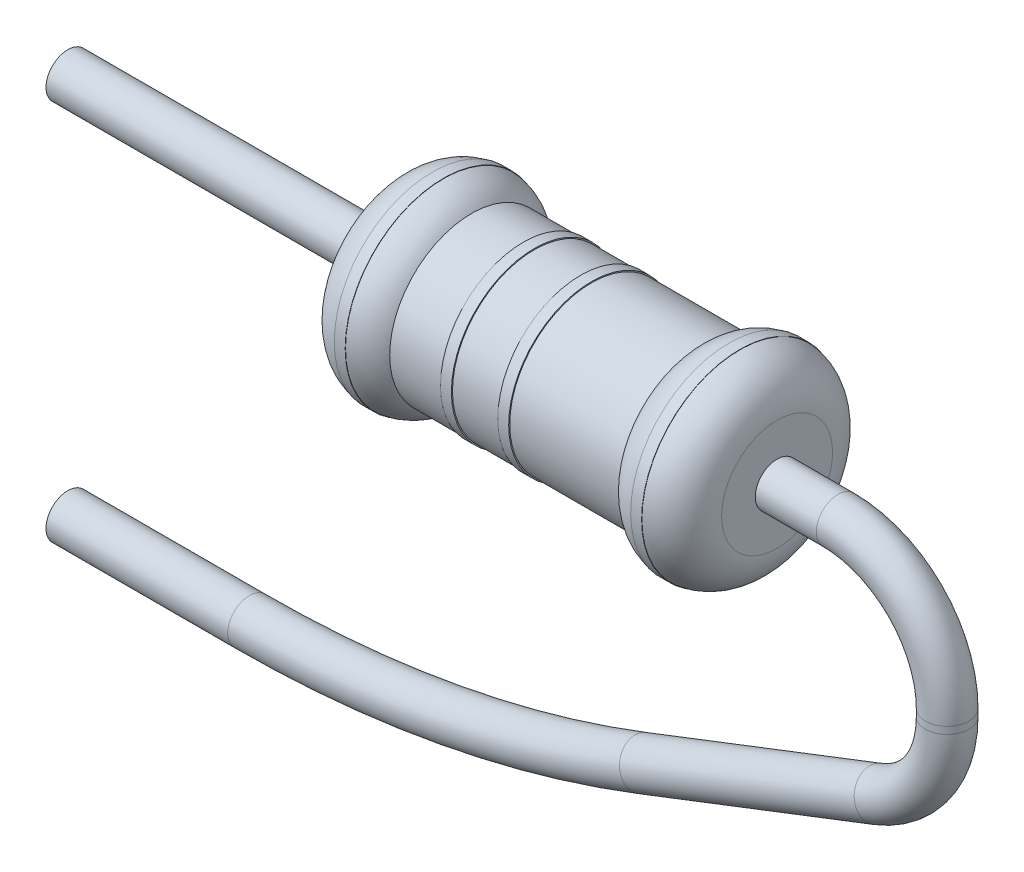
from build123d import *

# Parameters (mm, degrees)
ESQUISSE3_R = 0.2
ESQUISSE5_R = 0.2


with BuildPart() as part:
    # Esquisse1 → R_volution1 (revolve)
    with BuildSketch(Plane.XY, mode=Mode.PRIVATE) as r_volution1_sk:
        with BuildLine():
            Line((-1.75, 0), (1.75, 0))
            Line((1.75, 0), (1.75, 0.508257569))
            ThreePointArc((1.75, 0.508257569), (1.652408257, 0.766980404), (1.408257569, 0.896796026))
            Line((1.408257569, 0.896796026), (1.408257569, 0.9))
            Line((1.408257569, 0.9), (1.308257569, 0.9))
            Line((1.308257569, 0.9), (1.308257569, 0.896796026))
            ThreePointArc((1.308257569, 0.896796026), (1.164674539, 0.848827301), (1.05, 0.75))
            Line((1.05, 0.75), (0.05, 0.75))
            Line((0.05, 0.75), (0.05, 0.76))
            Line((0.05, 0.76), (-0.05, 0.76))
            Line((-0.05, 0.76), (-0.05, 0.75))
            Line((-0.05, 0.75), (-0.475, 0.75))
            Line((-0.475, 0.75), (-0.475, 0.76))
            Line((-0.475, 0.76), (-0.575, 0.76))
            Line((-0.575, 0.76), (-0.575, 0.75))
            Line((-0.575, 0.75), (-1.05, 0.75))
            ThreePointArc((-1.05, 0.75), (-1.164674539, 0.848827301), (-1.308257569, 0.896796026))
            Line((-1.308257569, 0.896796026), (-1.308257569, 0.9))
            Line((-1.308257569, 0.9), (-1.408257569, 0.9))
            Line((-1.408257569, 0.9), (-1.408257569, 0.896796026))
            ThreePointArc((-1.408257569, 0.896796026), (-1.652408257, 0.766980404), (-1.75, 0.508257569))
            Line((-1.75, 0.508257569), (-1.75, 0))
        make_face()
    revolve(r_volution1_sk.sketch.rotate(Axis((-9.420048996, 0, 0), (1, 0, 0)), 90), axis=Axis((-9.420048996, 0, 0), (1, 0, 0)))

    # Balayage1: sweep along a path in Esquisse2
    with BuildLine(Plane.XY) as balayage1_path:
        Line((-4.75, 0), (-1.75, 0))
    # Esquisse3 → Balayage1 (sweep)
    with BuildSketch(Plane.ZY.offset(1.75)):
        Circle(ESQUISSE3_R)
    sweep(path=balayage1_path.line)

    # Balayage2: sweep along a path in Esquisse4
    with BuildLine(Plane.XY) as balayage2_path:
        Line((-4.75, -3.5), (-3.085288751, -3.5))
        ThreePointArc((-3.085288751, -3.5), (-1.252219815, -3.330557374), (0.518729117, -2.827971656))
        Line((0.518729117, -2.827971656), (2.669152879, -1.997119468))
        ThreePointArc((2.669152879, -1.997119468), (3.133494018, -1.629830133), (3.308751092, -1.064322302))
        Line((3.308751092, -1.064322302), (3.308751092, -1))
        ThreePointArc((3.308751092, -1), (3.015857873, -0.292893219), (2.308751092, 0))
        Line((2.308751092, 0), (1.75, 0))
    # Esquisse5 → Balayage2 (sweep)
    with BuildSketch(Plane(origin=(1.75, 0, 0), x_dir=(0, 0, -1), z_dir=(1, 0, 0))):
        Circle(ESQUISSE5_R)
    sweep(path=balayage2_path.line)


solid = part.part
